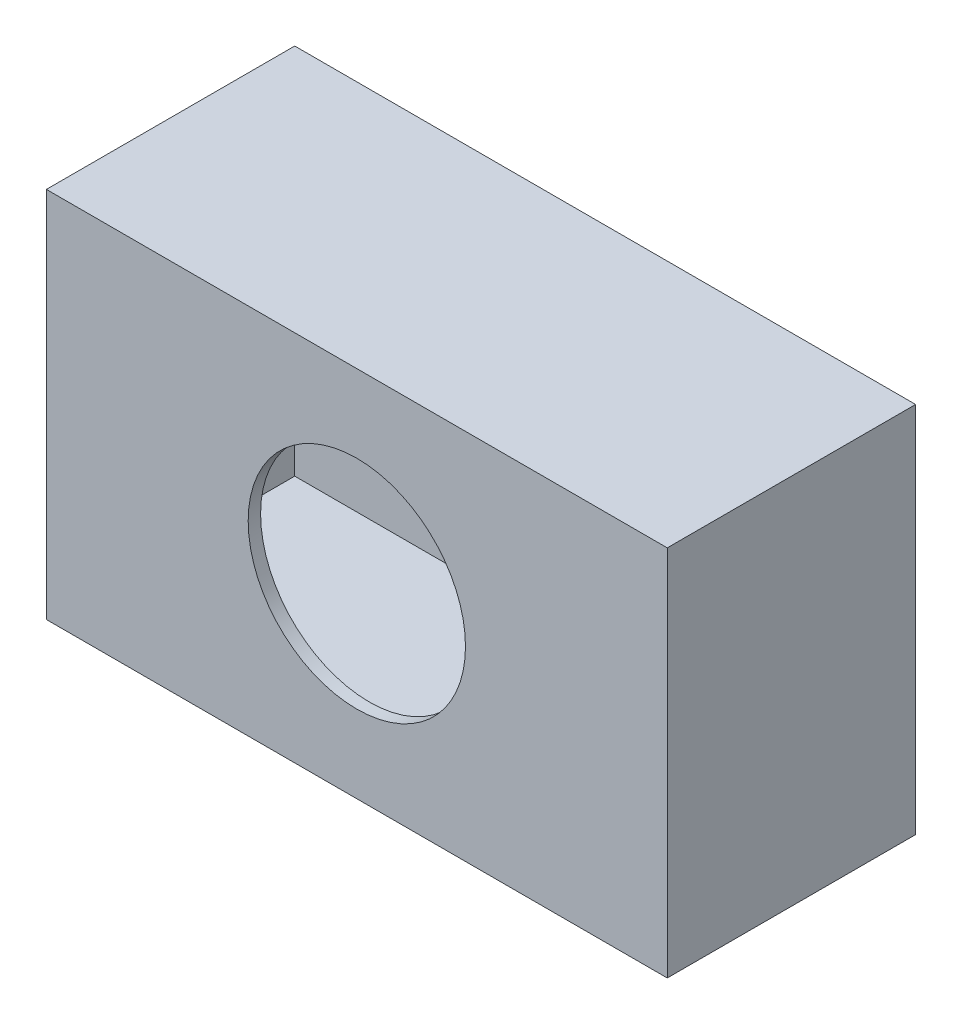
ISO-10303-21;
HEADER;
FILE_DESCRIPTION(('STEP AP214'),'2;1');
FILE_NAME('part.step','',(''),(''),'','','');
FILE_SCHEMA(('AUTOMOTIVE_DESIGN { 1 0 10303 214 1 1 1 1 }'));
ENDSEC;
DATA;
#1=APPLICATION_CONTEXT('core data for automotive mechanical design processes');
#2=APPLICATION_PROTOCOL_DEFINITION('international standard','automotive_design',2000,#1);
#3=PRODUCT_CONTEXT('',#1,'mechanical');
#4=PRODUCT('Part','Part','',(#3));
#5=PRODUCT_RELATED_PRODUCT_CATEGORY('part','',(#4));
#6=PRODUCT_DEFINITION_FORMATION('','',#4);
#7=PRODUCT_DEFINITION_CONTEXT('part definition',#1,'design');
#8=PRODUCT_DEFINITION('design','',#6,#7);
#9=PRODUCT_DEFINITION_SHAPE('','',#8);
#10=(LENGTH_UNIT() NAMED_UNIT(*) SI_UNIT(.MILLI.,.METRE.));
#11=(NAMED_UNIT(*) PLANE_ANGLE_UNIT() SI_UNIT($,.RADIAN.));
#12=(NAMED_UNIT(*) SI_UNIT($,.STERADIAN.) SOLID_ANGLE_UNIT());
#13=UNCERTAINTY_MEASURE_WITH_UNIT(LENGTH_MEASURE(1.E-05),#10,'distance_accuracy_value','');
#14=(GEOMETRIC_REPRESENTATION_CONTEXT(3) GLOBAL_UNCERTAINTY_ASSIGNED_CONTEXT((#13)) GLOBAL_UNIT_ASSIGNED_CONTEXT((#10,
#11,#12)) REPRESENTATION_CONTEXT('',''));
#15=CARTESIAN_POINT('',(0.,0.,0.));
#16=DIRECTION('',(0.,0.,1.));
#17=DIRECTION('',(1.,0.,0.));
#18=AXIS2_PLACEMENT_3D('',#15,#16,#17);
#19=CARTESIAN_POINT('',(0.,0.,40.));
#20=DIRECTION('',(0.,0.,1.));
#21=DIRECTION('',(1.,0.,0.));
#22=AXIS2_PLACEMENT_3D('',#19,#20,#21);
#23=PLANE('',#22);
#24=DIRECTION('',(0.,-1.,0.));
#25=VECTOR('',#24,1.);
#26=CARTESIAN_POINT('',(-50.,-30.,40.));
#27=LINE('',#26,#25);
#28=CARTESIAN_POINT('',(-50.,30.,40.));
#29=VERTEX_POINT('',#28);
#30=CARTESIAN_POINT('',(-50.,-30.,40.));
#31=VERTEX_POINT('',#30);
#32=EDGE_CURVE('E158',#29,#31,#27,.T.);
#33=ORIENTED_EDGE('',*,*,#32,.T.);
#34=DIRECTION('',(1.,0.,0.));
#35=VECTOR('',#34,1.);
#36=CARTESIAN_POINT('',(50.,-30.,40.));
#37=LINE('',#36,#35);
#38=CARTESIAN_POINT('',(50.,-30.,40.));
#39=VERTEX_POINT('',#38);
#40=EDGE_CURVE('E83',#31,#39,#37,.T.);
#41=ORIENTED_EDGE('',*,*,#40,.T.);
#42=DIRECTION('',(0.,1.,0.));
#43=VECTOR('',#42,1.);
#44=CARTESIAN_POINT('',(50.,-30.,40.));
#45=LINE('',#44,#43);
#46=CARTESIAN_POINT('',(50.,30.,40.));
#47=VERTEX_POINT('',#46);
#48=EDGE_CURVE('E161',#39,#47,#45,.T.);
#49=ORIENTED_EDGE('',*,*,#48,.T.);
#50=DIRECTION('',(-1.,0.,0.));
#51=VECTOR('',#50,1.);
#52=CARTESIAN_POINT('',(50.,30.,40.));
#53=LINE('',#52,#51);
#54=EDGE_CURVE('E52',#47,#29,#53,.T.);
#55=ORIENTED_EDGE('',*,*,#54,.T.);
#56=EDGE_LOOP('',(#33,#41,#49,#55));
#57=FACE_BOUND('',#56,.T.);
#58=CARTESIAN_POINT('',(0.,0.,40.));
#59=DIRECTION('',(0.,0.,1.));
#60=DIRECTION('',(1.,0.,0.));
#61=AXIS2_PLACEMENT_3D('',#58,#59,#60);
#62=CIRCLE('',#61,17.5);
#63=CARTESIAN_POINT('',(17.5,0.,40.));
#64=VERTEX_POINT('',#63);
#65=EDGE_CURVE('E145',#64,#64,#62,.F.);
#66=ORIENTED_EDGE('',*,*,#65,.T.);
#67=EDGE_LOOP('',(#66));
#68=FACE_BOUND('',#67,.T.);
#69=ADVANCED_FACE('F35',(#57,#68),#23,.T.);
#70=CARTESIAN_POINT('',(-50.,-30.,40.));
#71=DIRECTION('',(1.,0.,0.));
#72=DIRECTION('',(0.,0.,-1.));
#73=AXIS2_PLACEMENT_3D('',#70,#71,#72);
#74=PLANE('',#73);
#75=DIRECTION('',(0.,-1.,0.));
#76=VECTOR('',#75,1.);
#77=CARTESIAN_POINT('',(-50.,-30.,0.));
#78=LINE('',#77,#76);
#79=CARTESIAN_POINT('',(-50.,30.,0.));
#80=VERTEX_POINT('',#79);
#81=CARTESIAN_POINT('',(-50.,-30.,0.));
#82=VERTEX_POINT('',#81);
#83=EDGE_CURVE('E157',#80,#82,#78,.T.);
#84=ORIENTED_EDGE('',*,*,#83,.T.);
#85=DIRECTION('',(0.,0.,-1.));
#86=VECTOR('',#85,1.);
#87=CARTESIAN_POINT('',(-50.,-30.,40.));
#88=LINE('',#87,#86);
#89=EDGE_CURVE('E11',#31,#82,#88,.T.);
#90=ORIENTED_EDGE('',*,*,#89,.F.);
#91=ORIENTED_EDGE('',*,*,#32,.F.);
#92=DIRECTION('',(0.,0.,-1.));
#93=VECTOR('',#92,1.);
#94=CARTESIAN_POINT('',(-50.,30.,40.));
#95=LINE('',#94,#93);
#96=EDGE_CURVE('E164',#29,#80,#95,.T.);
#97=ORIENTED_EDGE('',*,*,#96,.T.);
#98=EDGE_LOOP('',(#84,#90,#91,#97));
#99=FACE_BOUND('',#98,.T.);
#100=ADVANCED_FACE('F37',(#99),#74,.F.);
#101=CARTESIAN_POINT('',(50.,-30.,40.));
#102=DIRECTION('',(0.,1.,0.));
#103=DIRECTION('',(-1.,0.,0.));
#104=AXIS2_PLACEMENT_3D('',#101,#102,#103);
#105=PLANE('',#104);
#106=DIRECTION('',(1.,0.,0.));
#107=VECTOR('',#106,1.);
#108=CARTESIAN_POINT('',(50.,-30.,0.));
#109=LINE('',#108,#107);
#110=CARTESIAN_POINT('',(50.,-30.,0.));
#111=VERTEX_POINT('',#110);
#112=EDGE_CURVE('E167',#82,#111,#109,.T.);
#113=ORIENTED_EDGE('',*,*,#112,.T.);
#114=DIRECTION('',(0.,0.,-1.));
#115=VECTOR('',#114,1.);
#116=CARTESIAN_POINT('',(50.,-30.,40.));
#117=LINE('',#116,#115);
#118=EDGE_CURVE('E44',#39,#111,#117,.T.);
#119=ORIENTED_EDGE('',*,*,#118,.F.);
#120=ORIENTED_EDGE('',*,*,#40,.F.);
#121=ORIENTED_EDGE('',*,*,#89,.T.);
#122=EDGE_LOOP('',(#113,#119,#120,#121));
#123=FACE_BOUND('',#122,.T.);
#124=ADVANCED_FACE('F190',(#123),#105,.F.);
#125=CARTESIAN_POINT('',(50.,-30.,40.));
#126=DIRECTION('',(-1.,0.,0.));
#127=DIRECTION('',(0.,0.,1.));
#128=AXIS2_PLACEMENT_3D('',#125,#126,#127);
#129=PLANE('',#128);
#130=DIRECTION('',(0.,1.,0.));
#131=VECTOR('',#130,1.);
#132=CARTESIAN_POINT('',(50.,-30.,0.));
#133=LINE('',#132,#131);
#134=CARTESIAN_POINT('',(50.,30.,0.));
#135=VERTEX_POINT('',#134);
#136=EDGE_CURVE('E70',#111,#135,#133,.T.);
#137=ORIENTED_EDGE('',*,*,#136,.T.);
#138=DIRECTION('',(0.,0.,-1.));
#139=VECTOR('',#138,1.);
#140=CARTESIAN_POINT('',(50.,30.,40.));
#141=LINE('',#140,#139);
#142=EDGE_CURVE('E172',#47,#135,#141,.T.);
#143=ORIENTED_EDGE('',*,*,#142,.F.);
#144=ORIENTED_EDGE('',*,*,#48,.F.);
#145=ORIENTED_EDGE('',*,*,#118,.T.);
#146=EDGE_LOOP('',(#137,#143,#144,#145));
#147=FACE_BOUND('',#146,.T.);
#148=ADVANCED_FACE('F174',(#147),#129,.F.);
#149=CARTESIAN_POINT('',(50.,30.,40.));
#150=DIRECTION('',(0.,-1.,0.));
#151=DIRECTION('',(1.,0.,0.));
#152=AXIS2_PLACEMENT_3D('',#149,#150,#151);
#153=PLANE('',#152);
#154=DIRECTION('',(-1.,0.,0.));
#155=VECTOR('',#154,1.);
#156=CARTESIAN_POINT('',(50.,30.,0.));
#157=LINE('',#156,#155);
#158=EDGE_CURVE('E76',#135,#80,#157,.T.);
#159=ORIENTED_EDGE('',*,*,#158,.T.);
#160=ORIENTED_EDGE('',*,*,#96,.F.);
#161=ORIENTED_EDGE('',*,*,#54,.F.);
#162=ORIENTED_EDGE('',*,*,#142,.T.);
#163=EDGE_LOOP('',(#159,#160,#161,#162));
#164=FACE_BOUND('',#163,.T.);
#165=ADVANCED_FACE('F181',(#164),#153,.F.);
#166=CARTESIAN_POINT('',(0.,0.,0.));
#167=DIRECTION('',(0.,0.,1.));
#168=DIRECTION('',(1.,0.,0.));
#169=AXIS2_PLACEMENT_3D('',#166,#167,#168);
#170=PLANE('',#169);
#171=ORIENTED_EDGE('',*,*,#83,.F.);
#172=ORIENTED_EDGE('',*,*,#158,.F.);
#173=ORIENTED_EDGE('',*,*,#136,.F.);
#174=ORIENTED_EDGE('',*,*,#112,.F.);
#175=EDGE_LOOP('',(#171,#172,#173,#174));
#176=FACE_BOUND('',#175,.T.);
#177=ADVANCED_FACE('F177',(#176),#170,.F.);
#178=CARTESIAN_POINT('',(0.,0.,40.));
#179=DIRECTION('',(0.,0.,1.));
#180=DIRECTION('',(1.,0.,0.));
#181=AXIS2_PLACEMENT_3D('',#178,#179,#180);
#182=CYLINDRICAL_SURFACE('',#181,17.5);
#183=ORIENTED_EDGE('',*,*,#65,.F.);
#184=EDGE_LOOP('',(#183));
#185=FACE_BOUND('',#184,.T.);
#186=CARTESIAN_POINT('',(0.,0.,38.));
#187=DIRECTION('',(0.,0.,1.));
#188=DIRECTION('',(1.,0.,0.));
#189=AXIS2_PLACEMENT_3D('',#186,#187,#188);
#190=CIRCLE('',#189,17.5);
#191=CARTESIAN_POINT('',(17.5,0.,38.));
#192=VERTEX_POINT('',#191);
#193=EDGE_CURVE('E153',#192,#192,#190,.F.);
#194=ORIENTED_EDGE('',*,*,#193,.T.);
#195=EDGE_LOOP('',(#194));
#196=FACE_BOUND('',#195,.T.);
#197=ADVANCED_FACE('F188',(#185,#196),#182,.F.);
#198=CARTESIAN_POINT('',(0.,0.,38.));
#199=DIRECTION('',(0.,0.,1.));
#200=DIRECTION('',(1.,0.,0.));
#201=AXIS2_PLACEMENT_3D('',#198,#199,#200);
#202=PLANE('',#201);
#203=DIRECTION('',(0.,-1.,0.));
#204=VECTOR('',#203,1.);
#205=CARTESIAN_POINT('',(-48.,-30.,38.));
#206=LINE('',#205,#204);
#207=CARTESIAN_POINT('',(-48.,28.,38.));
#208=VERTEX_POINT('',#207);
#209=CARTESIAN_POINT('',(-48.,-28.,38.));
#210=VERTEX_POINT('',#209);
#211=EDGE_CURVE('E122',#208,#210,#206,.T.);
#212=ORIENTED_EDGE('',*,*,#211,.F.);
#213=DIRECTION('',(-1.,0.,0.));
#214=VECTOR('',#213,1.);
#215=CARTESIAN_POINT('',(50.,28.,38.));
#216=LINE('',#215,#214);
#217=CARTESIAN_POINT('',(48.,28.,38.));
#218=VERTEX_POINT('',#217);
#219=EDGE_CURVE('E134',#218,#208,#216,.T.);
#220=ORIENTED_EDGE('',*,*,#219,.F.);
#221=DIRECTION('',(0.,1.,0.));
#222=VECTOR('',#221,1.);
#223=CARTESIAN_POINT('',(48.,-30.,38.));
#224=LINE('',#223,#222);
#225=CARTESIAN_POINT('',(48.,-28.,38.));
#226=VERTEX_POINT('',#225);
#227=EDGE_CURVE('E121',#226,#218,#224,.T.);
#228=ORIENTED_EDGE('',*,*,#227,.F.);
#229=DIRECTION('',(1.,0.,0.));
#230=VECTOR('',#229,1.);
#231=CARTESIAN_POINT('',(50.,-28.,38.));
#232=LINE('',#231,#230);
#233=EDGE_CURVE('E110',#210,#226,#232,.T.);
#234=ORIENTED_EDGE('',*,*,#233,.F.);
#235=EDGE_LOOP('',(#212,#220,#228,#234));
#236=FACE_BOUND('',#235,.T.);
#237=ORIENTED_EDGE('',*,*,#193,.F.);
#238=EDGE_LOOP('',(#237));
#239=FACE_BOUND('',#238,.T.);
#240=ADVANCED_FACE('F132',(#236,#239),#202,.F.);
#241=CARTESIAN_POINT('',(-48.,-30.,40.));
#242=DIRECTION('',(1.,0.,0.));
#243=DIRECTION('',(0.,0.,-1.));
#244=AXIS2_PLACEMENT_3D('',#241,#242,#243);
#245=PLANE('',#244);
#246=DIRECTION('',(0.,-1.,0.));
#247=VECTOR('',#246,1.);
#248=CARTESIAN_POINT('',(-48.,-30.,2.));
#249=LINE('',#248,#247);
#250=CARTESIAN_POINT('',(-48.,28.,2.));
#251=VERTEX_POINT('',#250);
#252=CARTESIAN_POINT('',(-48.,-28.,2.));
#253=VERTEX_POINT('',#252);
#254=EDGE_CURVE('E140',#251,#253,#249,.T.);
#255=ORIENTED_EDGE('',*,*,#254,.F.);
#256=DIRECTION('',(0.,0.,-1.));
#257=VECTOR('',#256,1.);
#258=CARTESIAN_POINT('',(-48.,28.,40.));
#259=LINE('',#258,#257);
#260=EDGE_CURVE('E136',#208,#251,#259,.T.);
#261=ORIENTED_EDGE('',*,*,#260,.F.);
#262=ORIENTED_EDGE('',*,*,#211,.T.);
#263=DIRECTION('',(0.,0.,-1.));
#264=VECTOR('',#263,1.);
#265=CARTESIAN_POINT('',(-48.,-28.,40.));
#266=LINE('',#265,#264);
#267=EDGE_CURVE('E116',#210,#253,#266,.T.);
#268=ORIENTED_EDGE('',*,*,#267,.T.);
#269=EDGE_LOOP('',(#255,#261,#262,#268));
#270=FACE_BOUND('',#269,.T.);
#271=ADVANCED_FACE('F211',(#270),#245,.T.);
#272=CARTESIAN_POINT('',(50.,-28.,40.));
#273=DIRECTION('',(0.,1.,0.));
#274=DIRECTION('',(-1.,0.,0.));
#275=AXIS2_PLACEMENT_3D('',#272,#273,#274);
#276=PLANE('',#275);
#277=DIRECTION('',(1.,0.,0.));
#278=VECTOR('',#277,1.);
#279=CARTESIAN_POINT('',(50.,-28.,2.));
#280=LINE('',#279,#278);
#281=CARTESIAN_POINT('',(48.,-28.,2.));
#282=VERTEX_POINT('',#281);
#283=EDGE_CURVE('E143',#253,#282,#280,.T.);
#284=ORIENTED_EDGE('',*,*,#283,.F.);
#285=ORIENTED_EDGE('',*,*,#267,.F.);
#286=ORIENTED_EDGE('',*,*,#233,.T.);
#287=DIRECTION('',(0.,0.,-1.));
#288=VECTOR('',#287,1.);
#289=CARTESIAN_POINT('',(48.,-28.,40.));
#290=LINE('',#289,#288);
#291=EDGE_CURVE('E113',#226,#282,#290,.T.);
#292=ORIENTED_EDGE('',*,*,#291,.T.);
#293=EDGE_LOOP('',(#284,#285,#286,#292));
#294=FACE_BOUND('',#293,.T.);
#295=ADVANCED_FACE('F112',(#294),#276,.T.);
#296=CARTESIAN_POINT('',(48.,-30.,40.));
#297=DIRECTION('',(-1.,0.,0.));
#298=DIRECTION('',(0.,0.,1.));
#299=AXIS2_PLACEMENT_3D('',#296,#297,#298);
#300=PLANE('',#299);
#301=DIRECTION('',(0.,1.,0.));
#302=VECTOR('',#301,1.);
#303=CARTESIAN_POINT('',(48.,-30.,2.));
#304=LINE('',#303,#302);
#305=CARTESIAN_POINT('',(48.,28.,2.));
#306=VERTEX_POINT('',#305);
#307=EDGE_CURVE('E128',#282,#306,#304,.T.);
#308=ORIENTED_EDGE('',*,*,#307,.F.);
#309=ORIENTED_EDGE('',*,*,#291,.F.);
#310=ORIENTED_EDGE('',*,*,#227,.T.);
#311=DIRECTION('',(0.,0.,-1.));
#312=VECTOR('',#311,1.);
#313=CARTESIAN_POINT('',(48.,28.,40.));
#314=LINE('',#313,#312);
#315=EDGE_CURVE('E129',#218,#306,#314,.T.);
#316=ORIENTED_EDGE('',*,*,#315,.T.);
#317=EDGE_LOOP('',(#308,#309,#310,#316));
#318=FACE_BOUND('',#317,.T.);
#319=ADVANCED_FACE('F125',(#318),#300,.T.);
#320=CARTESIAN_POINT('',(50.,28.,40.));
#321=DIRECTION('',(0.,-1.,0.));
#322=DIRECTION('',(1.,0.,0.));
#323=AXIS2_PLACEMENT_3D('',#320,#321,#322);
#324=PLANE('',#323);
#325=DIRECTION('',(-1.,0.,0.));
#326=VECTOR('',#325,1.);
#327=CARTESIAN_POINT('',(50.,28.,2.));
#328=LINE('',#327,#326);
#329=EDGE_CURVE('E150',#306,#251,#328,.T.);
#330=ORIENTED_EDGE('',*,*,#329,.F.);
#331=ORIENTED_EDGE('',*,*,#315,.F.);
#332=ORIENTED_EDGE('',*,*,#219,.T.);
#333=ORIENTED_EDGE('',*,*,#260,.T.);
#334=EDGE_LOOP('',(#330,#331,#332,#333));
#335=FACE_BOUND('',#334,.T.);
#336=ADVANCED_FACE('F202',(#335),#324,.T.);
#337=CARTESIAN_POINT('',(0.,0.,2.));
#338=DIRECTION('',(0.,0.,1.));
#339=DIRECTION('',(1.,0.,0.));
#340=AXIS2_PLACEMENT_3D('',#337,#338,#339);
#341=PLANE('',#340);
#342=ORIENTED_EDGE('',*,*,#254,.T.);
#343=ORIENTED_EDGE('',*,*,#283,.T.);
#344=ORIENTED_EDGE('',*,*,#307,.T.);
#345=ORIENTED_EDGE('',*,*,#329,.T.);
#346=EDGE_LOOP('',(#342,#343,#344,#345));
#347=FACE_BOUND('',#346,.T.);
#348=ADVANCED_FACE('F199',(#347),#341,.T.);
#349=CLOSED_SHELL('',(#69,#100,#124,#148,#165,#177,#197,#240,#271,#295,#319,#336,#348));
#350=MANIFOLD_SOLID_BREP('B2',#349);
#351=ADVANCED_BREP_SHAPE_REPRESENTATION('',(#18,#350),#14);
#352=SHAPE_DEFINITION_REPRESENTATION(#9,#351);
ENDSEC;
END-ISO-10303-21;
